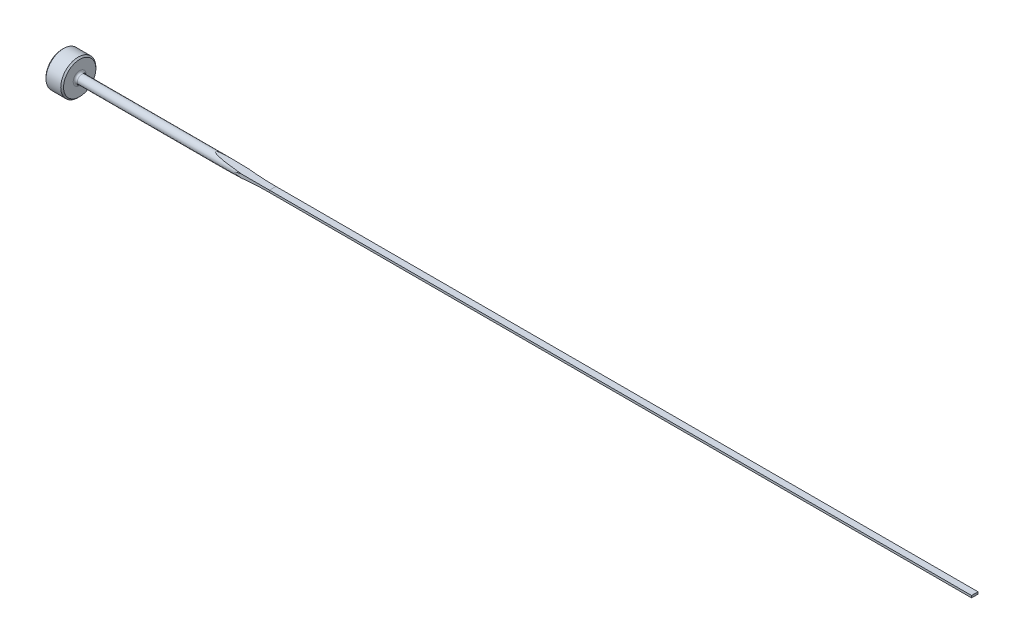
ISO-10303-21;
HEADER;
FILE_DESCRIPTION(('STEP AP214'),'2;1');
FILE_NAME('part.step','',(''),(''),'','','');
FILE_SCHEMA(('AUTOMOTIVE_DESIGN { 1 0 10303 214 1 1 1 1 }'));
ENDSEC;
DATA;
#1=APPLICATION_CONTEXT('core data for automotive mechanical design processes');
#2=APPLICATION_PROTOCOL_DEFINITION('international standard','automotive_design',2000,#1);
#3=PRODUCT_CONTEXT('',#1,'mechanical');
#4=PRODUCT('Part','Part','',(#3));
#5=PRODUCT_RELATED_PRODUCT_CATEGORY('part','',(#4));
#6=PRODUCT_DEFINITION_FORMATION('','',#4);
#7=PRODUCT_DEFINITION_CONTEXT('part definition',#1,'design');
#8=PRODUCT_DEFINITION('design','',#6,#7);
#9=PRODUCT_DEFINITION_SHAPE('','',#8);
#10=(LENGTH_UNIT() NAMED_UNIT(*) SI_UNIT(.MILLI.,.METRE.));
#11=(NAMED_UNIT(*) PLANE_ANGLE_UNIT() SI_UNIT($,.RADIAN.));
#12=(NAMED_UNIT(*) SI_UNIT($,.STERADIAN.) SOLID_ANGLE_UNIT());
#13=UNCERTAINTY_MEASURE_WITH_UNIT(LENGTH_MEASURE(1.E-05),#10,'distance_accuracy_value','');
#14=(GEOMETRIC_REPRESENTATION_CONTEXT(3) GLOBAL_UNCERTAINTY_ASSIGNED_CONTEXT((#13)) GLOBAL_UNIT_ASSIGNED_CONTEXT((#10,
#11,#12)) REPRESENTATION_CONTEXT('',''));
#15=CARTESIAN_POINT('',(0.,0.,0.));
#16=DIRECTION('',(0.,0.,1.));
#17=DIRECTION('',(1.,0.,0.));
#18=AXIS2_PLACEMENT_3D('',#15,#16,#17);
#19=CARTESIAN_POINT('',(0.,0.,0.));
#20=DIRECTION('',(-1.,0.,0.));
#21=DIRECTION('',(0.,0.,1.));
#22=AXIS2_PLACEMENT_3D('',#19,#20,#21);
#23=CYLINDRICAL_SURFACE('',#22,0.79375);
#24=CARTESIAN_POINT('',(3.556,0.,0.));
#25=DIRECTION('',(-1.,0.,0.));
#26=DIRECTION('',(0.,0.,1.));
#27=AXIS2_PLACEMENT_3D('',#24,#25,#26);
#28=CIRCLE('',#27,0.79375);
#29=CARTESIAN_POINT('',(3.556,0.,0.79375));
#30=VERTEX_POINT('',#29);
#31=EDGE_CURVE('E153',#30,#30,#28,.F.);
#32=ORIENTED_EDGE('',*,*,#31,.T.);
#33=EDGE_LOOP('',(#32));
#34=FACE_BOUND('',#33,.T.);
#35=CARTESIAN_POINT('',(38.1,0.537354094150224,0.584199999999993));
#36=CARTESIAN_POINT('',(37.9677986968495,0.537352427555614,0.584199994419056));
#37=CARTESIAN_POINT('',(37.8355977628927,0.537033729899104,0.584494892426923));
#38=CARTESIAN_POINT('',(37.5711986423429,0.535747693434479,0.585674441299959));
#39=CARTESIAN_POINT('',(37.4390004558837,0.534780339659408,0.586559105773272));
#40=CARTESIAN_POINT('',(37.0420069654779,0.53087936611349,0.590101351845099));
#41=CARTESIAN_POINT('',(36.7772280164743,0.526946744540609,0.593647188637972));
#42=CARTESIAN_POINT('',(36.2475584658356,0.516094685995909,0.603107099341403));
#43=CARTESIAN_POINT('',(35.9826679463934,0.509172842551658,0.609023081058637));
#44=CARTESIAN_POINT('',(35.4530338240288,0.491693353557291,0.623220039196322));
#45=CARTESIAN_POINT('',(35.18829024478,0.481135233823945,0.631501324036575));
#46=CARTESIAN_POINT('',(34.6594832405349,0.455276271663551,0.650407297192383));
#47=CARTESIAN_POINT('',(34.3954193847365,0.439982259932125,0.661028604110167));
#48=CARTESIAN_POINT('',(33.99981069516,0.411723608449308,0.678705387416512));
#49=CARTESIAN_POINT('',(33.8680369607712,0.401419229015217,0.684887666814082));
#50=CARTESIAN_POINT('',(33.604722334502,0.378486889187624,0.697828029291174));
#51=CARTESIAN_POINT('',(33.4731814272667,0.365859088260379,0.704586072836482));
#52=CARTESIAN_POINT('',(33.2761769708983,0.344482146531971,0.715145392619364));
#53=CARTESIAN_POINT('',(33.2105699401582,0.336951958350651,0.71873496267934));
#54=CARTESIAN_POINT('',(33.0794798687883,0.320881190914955,0.726052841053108));
#55=CARTESIAN_POINT('',(33.0139968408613,0.312340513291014,0.729781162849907));
#56=CARTESIAN_POINT('',(32.8830735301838,0.293954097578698,0.737380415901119));
#57=CARTESIAN_POINT('',(32.8176336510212,0.284105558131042,0.741251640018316));
#58=CARTESIAN_POINT('',(32.6870608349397,0.262655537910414,0.749120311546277));
#59=CARTESIAN_POINT('',(32.6219278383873,0.251054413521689,0.753117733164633));
#60=CARTESIAN_POINT('',(32.4919403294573,0.22526665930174,0.761238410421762));
#61=CARTESIAN_POINT('',(32.4270873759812,0.211071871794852,0.765362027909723));
#62=CARTESIAN_POINT('',(32.3307839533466,0.1864338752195,0.771589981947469));
#63=CARTESIAN_POINT('',(32.2989102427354,0.177685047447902,0.773668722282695));
#64=CARTESIAN_POINT('',(32.2356848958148,0.158500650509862,0.777825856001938));
#65=CARTESIAN_POINT('',(32.2043331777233,0.148065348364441,0.779904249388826));
#66=CARTESIAN_POINT('',(32.1449685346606,0.12536357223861,0.783870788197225));
#67=CARTESIAN_POINT('',(32.1168860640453,0.113303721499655,0.785761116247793));
#68=CARTESIAN_POINT('',(32.0787827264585,0.0926836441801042,0.788342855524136));
#69=CARTESIAN_POINT('',(32.0676987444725,0.0861257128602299,0.789096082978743));
#70=CARTESIAN_POINT('',(32.0464596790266,0.0716589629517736,0.790543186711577));
#71=CARTESIAN_POINT('',(32.0362989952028,0.0637592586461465,0.791237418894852));
#72=CARTESIAN_POINT('',(32.0241935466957,0.0517558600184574,0.792066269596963));
#73=CARTESIAN_POINT('',(32.0212914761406,0.0486376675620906,0.792265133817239));
#74=CARTESIAN_POINT('',(32.0158307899,0.0421001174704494,0.792639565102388));
#75=CARTESIAN_POINT('',(32.0132726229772,0.0386803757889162,0.792815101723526));
#76=CARTESIAN_POINT('',(32.0086203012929,0.0314630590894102,0.793134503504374));
#77=CARTESIAN_POINT('',(32.0065328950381,0.0276609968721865,0.793277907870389));
#78=CARTESIAN_POINT('',(32.0030925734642,0.0197374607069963,0.793514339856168));
#79=CARTESIAN_POINT('',(32.0017370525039,0.0156171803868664,0.793607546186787));
#80=CARTESIAN_POINT('',(32.0002141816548,0.00832744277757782,0.793712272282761));
#81=CARTESIAN_POINT('',(31.9998236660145,0.00520497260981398,0.793739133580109));
#82=CARTESIAN_POINT('',(31.9995863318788,-0.00106099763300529,0.793755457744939));
#83=CARTESIAN_POINT('',(31.9997393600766,-0.00420449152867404,0.793744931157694));
#84=CARTESIAN_POINT('',(32.0005699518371,-0.0104090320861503,0.793687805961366));
#85=CARTESIAN_POINT('',(32.0012458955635,-0.013470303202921,0.793641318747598));
#86=CARTESIAN_POINT('',(32.0030509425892,-0.0194544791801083,0.793517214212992));
#87=CARTESIAN_POINT('',(32.0041804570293,-0.0223772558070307,0.79343956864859));
#88=CARTESIAN_POINT('',(32.0075834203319,-0.0297362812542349,0.793205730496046));
#89=CARTESIAN_POINT('',(32.010137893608,-0.0340408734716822,0.793030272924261));
#90=CARTESIAN_POINT('',(32.0158647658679,-0.0422141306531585,0.792637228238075));
#91=CARTESIAN_POINT('',(32.0190391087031,-0.0460813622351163,0.792419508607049));
#92=CARTESIAN_POINT('',(32.0306425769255,-0.0587562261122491,0.791624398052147));
#93=CARTESIAN_POINT('',(32.0400482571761,-0.0666461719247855,0.790981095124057));
#94=CARTESIAN_POINT('',(32.0598384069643,-0.0810740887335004,0.78963111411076));
#95=CARTESIAN_POINT('',(32.070228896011,-0.0876028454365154,0.788924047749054));
#96=CARTESIAN_POINT('',(32.1002052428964,-0.104735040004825,0.786889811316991));
#97=CARTESIAN_POINT('',(32.1203710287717,-0.114312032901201,0.785527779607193));
#98=CARTESIAN_POINT('',(32.1614041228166,-0.131848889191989,0.782770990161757));
#99=CARTESIAN_POINT('',(32.1822732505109,-0.13980411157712,0.78137615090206));
#100=CARTESIAN_POINT('',(32.2454933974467,-0.162091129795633,0.777173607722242));
#101=CARTESIAN_POINT('',(32.288404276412,-0.17481938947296,0.774351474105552));
#102=CARTESIAN_POINT('',(32.4170052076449,-0.20942402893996,0.765989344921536));
#103=CARTESIAN_POINT('',(32.5035078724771,-0.228079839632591,0.760489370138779));
#104=CARTESIAN_POINT('',(32.6773949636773,-0.261317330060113,0.749691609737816));
#105=CARTESIAN_POINT('',(32.7647806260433,-0.275892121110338,0.744394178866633));
#106=CARTESIAN_POINT('',(32.9398406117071,-0.302364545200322,0.734042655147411));
#107=CARTESIAN_POINT('',(33.0275143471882,-0.314265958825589,0.728988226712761));
#108=CARTESIAN_POINT('',(33.2030327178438,-0.336200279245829,0.719131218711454));
#109=CARTESIAN_POINT('',(33.2908771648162,-0.346234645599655,0.714328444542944));
#110=CARTESIAN_POINT('',(33.5696341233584,-0.375842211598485,0.699503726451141));
#111=CARTESIAN_POINT('',(33.7608447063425,-0.392834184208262,0.689952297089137));
#112=CARTESIAN_POINT('',(34.1436524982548,-0.422669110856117,0.672072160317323));
#113=CARTESIAN_POINT('',(34.3352497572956,-0.435511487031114,0.663743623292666));
#114=CARTESIAN_POINT('',(34.718807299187,-0.458164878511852,0.648315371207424));
#115=CARTESIAN_POINT('',(34.9107677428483,-0.467973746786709,0.641216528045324));
#116=CARTESIAN_POINT('',(35.2948219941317,-0.485222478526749,0.628261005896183));
#117=CARTESIAN_POINT('',(35.4869157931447,-0.492662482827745,0.622404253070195));
#118=CARTESIAN_POINT('',(36.0633489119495,-0.512094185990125,0.60670099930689));
#119=CARTESIAN_POINT('',(36.447838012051,-0.521197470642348,0.59872158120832));
#120=CARTESIAN_POINT('',(37.2168658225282,-0.533520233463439,0.587755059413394));
#121=CARTESIAN_POINT('',(37.6014044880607,-0.536741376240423,0.584766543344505));
#122=CARTESIAN_POINT('',(38.0239617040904,-0.537327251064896,0.584224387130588));
#123=CARTESIAN_POINT('',(38.0619808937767,-0.537353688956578,0.584199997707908));
#124=CARTESIAN_POINT('',(38.1,-0.537354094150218,0.584199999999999));
#125=B_SPLINE_CURVE_WITH_KNOTS('',3,(#35,#36,#37,#38,#39,#40,#41,#42,#43,#44,#45,#46,#47,#48,
#49,#50,#51,#52,#53,#54,#55,#56,#57,#58,#59,#60,#61,#62,#63,#64,#65,#66,#67,#68,#69,#70,#71,#72,
#73,#74,#75,#76,#77,#78,#79,#80,#81,#82,#83,#84,#85,#86,#87,#88,#89,#90,#91,#92,#93,#94,#95,#96,
#97,#98,#99,#100,#101,#102,#103,#104,#105,#106,#107,#108,#109,#110,#111,#112,#113,#114,#115,
#116,#117,#118,#119,#120,#121,#122,#123,#124),.UNSPECIFIED.,.F.,.F.,(4,2,2,2,2,2,2,2,2,2,2,2,2,
2,2,2,2,2,2,2,2,2,2,2,2,2,2,2,2,2,2,2,2,2,2,2,2,2,2,2,2,2,2,2,4),(0.,0.396602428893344,
0.793214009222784,1.58768292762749,2.38279262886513,3.1780060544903,3.97207782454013,
4.36902531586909,4.76594557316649,4.9643452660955,5.16276428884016,5.36161538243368,
5.56042609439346,5.75987322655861,5.85918782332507,5.95848671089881,6.05003157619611,
6.08869793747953,6.12711144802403,6.13988635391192,6.15267777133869,6.16564230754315,
6.17856037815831,6.18795697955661,6.19735093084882,6.20671589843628,6.21608937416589,
6.23102781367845,6.24601387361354,6.28261070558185,6.3194477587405,6.38636719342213,
6.45347552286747,6.58786698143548,6.85363398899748,7.11984693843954,7.38568101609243,
7.65130639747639,8.22782048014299,8.80441481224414,9.38141631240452,9.95838350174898,
11.1123237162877,12.2659373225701,12.37999486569),.UNSPECIFIED.);
#126=CARTESIAN_POINT('',(33.1437773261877,0.328763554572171,0.722463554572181));
#127=VERTEX_POINT('',#126);
#128=CARTESIAN_POINT('',(33.1437773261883,-0.328763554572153,0.722463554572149));
#129=VERTEX_POINT('',#128);
#130=EDGE_CURVE('E156',#127,#129,#125,.T.);
#131=ORIENTED_EDGE('',*,*,#130,.F.);
#132=CARTESIAN_POINT('',(38.1,0.190499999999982,0.770550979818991));
#133=CARTESIAN_POINT('',(37.8354977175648,0.190500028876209,0.770543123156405));
#134=CARTESIAN_POINT('',(37.5709978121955,0.191680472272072,0.770261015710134));
#135=CARTESIAN_POINT('',(37.0418252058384,0.196403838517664,0.769072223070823));
#136=CARTESIAN_POINT('',(36.7771525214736,0.19994850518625,0.768165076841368));
#137=CARTESIAN_POINT('',(35.9824806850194,0.214141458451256,0.764388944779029));
#138=CARTESIAN_POINT('',(35.4525422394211,0.22834871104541,0.760464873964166));
#139=CARTESIAN_POINT('',(34.6578861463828,0.256766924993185,0.751134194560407));
#140=CARTESIAN_POINT('',(34.393015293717,0.267425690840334,0.747449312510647));
#141=CARTESIAN_POINT('',(33.8634058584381,0.291110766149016,0.738549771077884));
#142=CARTESIAN_POINT('',(33.5986672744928,0.3041370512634,0.733335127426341));
#143=CARTESIAN_POINT('',(33.0695875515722,0.332542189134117,0.720898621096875));
#144=CARTESIAN_POINT('',(32.8052462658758,0.347919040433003,0.713678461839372));
#145=CARTESIAN_POINT('',(32.2767983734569,0.381028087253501,0.696567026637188));
#146=CARTESIAN_POINT('',(32.0126917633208,0.398760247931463,0.686675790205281));
#147=CARTESIAN_POINT('',(31.4849021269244,0.436563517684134,0.663283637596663));
#148=CARTESIAN_POINT('',(31.2212189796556,0.456633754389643,0.649784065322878));
#149=CARTESIAN_POINT('',(30.6943507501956,0.49909984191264,0.61778429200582));
#150=CARTESIAN_POINT('',(30.431165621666,0.521495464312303,0.599284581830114));
#151=CARTESIAN_POINT('',(30.0370166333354,0.556801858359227,0.56592143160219));
#152=CARTESIAN_POINT('',(29.9057389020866,0.568856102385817,0.553864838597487));
#153=CARTESIAN_POINT('',(29.6434383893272,0.59352876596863,0.527346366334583));
#154=CARTESIAN_POINT('',(29.5124156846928,0.606147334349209,0.512883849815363));
#155=CARTESIAN_POINT('',(29.2506137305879,0.631946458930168,0.480735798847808));
#156=CARTESIAN_POINT('',(29.1198351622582,0.645127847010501,0.463045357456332));
#157=CARTESIAN_POINT('',(28.8590586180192,0.671994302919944,0.423151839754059));
#158=CARTESIAN_POINT('',(28.7290602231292,0.685679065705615,0.400951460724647));
#159=CARTESIAN_POINT('',(28.5485864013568,0.705076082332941,0.364742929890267));
#160=CARTESIAN_POINT('',(28.4974648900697,0.710615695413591,0.353876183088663));
#161=CARTESIAN_POINT('',(28.3955354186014,0.721749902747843,0.33058349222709));
#162=CARTESIAN_POINT('',(28.3447277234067,0.727344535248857,0.318156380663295));
#163=CARTESIAN_POINT('',(28.2437790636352,0.738547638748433,0.291200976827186));
#164=CARTESIAN_POINT('',(28.1936370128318,0.744156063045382,0.276676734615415));
#165=CARTESIAN_POINT('',(28.0943683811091,0.755343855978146,0.244529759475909));
#166=CARTESIAN_POINT('',(28.0452403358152,0.760923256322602,0.226911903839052));
#167=CARTESIAN_POINT('',(27.9731852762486,0.769164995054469,0.196296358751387));
#168=CARTESIAN_POINT('',(27.9493942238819,0.771896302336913,0.185367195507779));
#169=CARTESIAN_POINT('',(27.9028927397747,0.777253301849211,0.161463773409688));
#170=CARTESIAN_POINT('',(27.8801786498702,0.779879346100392,0.148497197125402));
#171=CARTESIAN_POINT('',(27.8500391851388,0.783374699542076,0.128048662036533));
#172=CARTESIAN_POINT('',(27.8416704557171,0.784346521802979,0.121988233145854));
#173=CARTESIAN_POINT('',(27.8254335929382,0.786234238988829,0.109166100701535));
#174=CARTESIAN_POINT('',(27.8175668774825,0.787149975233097,0.102402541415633));
#175=CARTESIAN_POINT('',(27.8025456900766,0.788900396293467,0.087916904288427));
#176=CARTESIAN_POINT('',(27.7954016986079,0.789733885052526,0.0801836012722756));
#177=CARTESIAN_POINT('',(27.7825061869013,0.791239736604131,0.0636171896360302));
#178=CARTESIAN_POINT('',(27.7767475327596,0.791912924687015,0.0547900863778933));
#179=CARTESIAN_POINT('',(27.7696621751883,0.792741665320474,0.0403159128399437));
#180=CARTESIAN_POINT('',(27.7675163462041,0.792992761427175,0.0350797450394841));
#181=CARTESIAN_POINT('',(27.764077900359,0.793395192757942,0.0243299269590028));
#182=CARTESIAN_POINT('',(27.7627841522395,0.793546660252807,0.0188166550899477));
#183=CARTESIAN_POINT('',(27.7611884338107,0.793733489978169,0.00760256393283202));
#184=CARTESIAN_POINT('',(27.7608934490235,0.793768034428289,0.00190070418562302));
#185=CARTESIAN_POINT('',(27.7613552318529,0.793713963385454,-0.00946090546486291));
#186=CARTESIAN_POINT('',(27.7621124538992,0.793625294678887,-0.0151206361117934));
#187=CARTESIAN_POINT('',(27.76448784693,0.793347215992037,-0.025801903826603));
#188=CARTESIAN_POINT('',(27.7660373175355,0.793165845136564,-0.0308394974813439));
#189=CARTESIAN_POINT('',(27.7698145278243,0.792723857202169,-0.0406454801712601));
#190=CARTESIAN_POINT('',(27.772042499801,0.792463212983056,-0.0454137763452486));
#191=CARTESIAN_POINT('',(27.7790063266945,0.791648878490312,-0.0583107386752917));
#192=CARTESIAN_POINT('',(27.7843320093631,0.791026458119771,-0.0661144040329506));
#193=CARTESIAN_POINT('',(27.796067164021,0.78965626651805,-0.0808494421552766));
#194=CARTESIAN_POINT('',(27.8024807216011,0.788908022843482,-0.0877773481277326));
#195=CARTESIAN_POINT('',(27.8270824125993,0.786040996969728,-0.11176765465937));
#196=CARTESIAN_POINT('',(27.8472565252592,0.78369571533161,-0.126716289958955));
#197=CARTESIAN_POINT('',(27.8893601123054,0.778817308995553,-0.153835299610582));
#198=CARTESIAN_POINT('',(27.9113004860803,0.776283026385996,-0.165986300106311));
#199=CARTESIAN_POINT('',(27.9770598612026,0.768713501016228,-0.199075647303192));
#200=CARTESIAN_POINT('',(28.0220934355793,0.763562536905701,-0.217563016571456));
#201=CARTESIAN_POINT('',(28.1134440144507,0.753187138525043,-0.251080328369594));
#202=CARTESIAN_POINT('',(28.1597643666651,0.747962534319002,-0.266100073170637));
#203=CARTESIAN_POINT('',(28.2531707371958,0.73750253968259,-0.293855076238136));
#204=CARTESIAN_POINT('',(28.3002578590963,0.732267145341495,-0.30658665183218));
#205=CARTESIAN_POINT('',(28.3947678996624,0.721836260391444,-0.330390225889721));
#206=CARTESIAN_POINT('',(28.442190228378,0.716640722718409,-0.341464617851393));
#207=CARTESIAN_POINT('',(28.5839153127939,0.701229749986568,-0.372633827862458));
#208=CARTESIAN_POINT('',(28.6786194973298,0.691084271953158,-0.390933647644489));
#209=CARTESIAN_POINT('',(28.8686125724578,0.671041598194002,-0.424400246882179));
#210=CARTESIAN_POINT('',(28.9639016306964,0.661144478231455,-0.439566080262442));
#211=CARTESIAN_POINT('',(29.1549690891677,0.641612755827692,-0.467616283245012));
#212=CARTESIAN_POINT('',(29.2507479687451,0.631978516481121,-0.4804976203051));
#213=CARTESIAN_POINT('',(29.442558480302,0.613000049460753,-0.504481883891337));
#214=CARTESIAN_POINT('',(29.5385901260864,0.603655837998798,-0.515584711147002));
#215=CARTESIAN_POINT('',(29.8266907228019,0.576097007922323,-0.546742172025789));
#216=CARTESIAN_POINT('',(30.0190308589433,0.558329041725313,-0.564682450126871));
#217=CARTESIAN_POINT('',(30.4039936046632,0.524034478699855,-0.596629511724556));
#218=CARTESIAN_POINT('',(30.5966159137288,0.507507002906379,-0.610639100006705));
#219=CARTESIAN_POINT('',(31.0885389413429,0.466916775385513,-0.642671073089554));
#220=CARTESIAN_POINT('',(31.3880448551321,0.443729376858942,-0.658640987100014));
#221=CARTESIAN_POINT('',(31.987497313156,0.400378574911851,-0.68584330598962));
#222=CARTESIAN_POINT('',(32.2874438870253,0.380215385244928,-0.697075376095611));
#223=CARTESIAN_POINT('',(32.8877695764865,0.342918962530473,-0.716159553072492));
#224=CARTESIAN_POINT('',(33.1881488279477,0.325787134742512,-0.724010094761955));
#225=CARTESIAN_POINT('',(33.7891202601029,0.29457185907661,-0.737260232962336));
#226=CARTESIAN_POINT('',(34.0897124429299,0.28048844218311,-0.74265980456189));
#227=CARTESIAN_POINT('',(34.690987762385,0.25537655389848,-0.751664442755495));
#228=CARTESIAN_POINT('',(34.9916708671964,0.244347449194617,-0.755269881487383));
#229=CARTESIAN_POINT('',(35.5931486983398,0.225342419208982,-0.761156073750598));
#230=CARTESIAN_POINT('',(35.8939434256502,0.217366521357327,-0.763436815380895));
#231=CARTESIAN_POINT('',(36.495546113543,0.204470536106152,-0.766991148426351));
#232=CARTESIAN_POINT('',(36.7963540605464,0.199549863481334,-0.768264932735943));
#233=CARTESIAN_POINT('',(37.3980062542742,0.192762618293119,-0.769996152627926));
#234=CARTESIAN_POINT('',(37.6988505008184,0.190896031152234,-0.770453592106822));
#235=CARTESIAN_POINT('',(38.0331297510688,0.19051886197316,-0.770546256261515));
#236=CARTESIAN_POINT('',(38.06656488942,0.190499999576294,-0.77055090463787));
#237=CARTESIAN_POINT('',(38.1,0.190499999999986,-0.77055097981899));
#238=B_SPLINE_CURVE_WITH_KNOTS('',3,(#132,#133,#134,#135,#136,#137,#138,#139,#140,#141,#142,
#143,#144,#145,#146,#147,#148,#149,#150,#151,#152,#153,#154,#155,#156,#157,#158,#159,#160,#161,
#162,#163,#164,#165,#166,#167,#168,#169,#170,#171,#172,#173,#174,#175,#176,#177,#178,#179,#180,
#181,#182,#183,#184,#185,#186,#187,#188,#189,#190,#191,#192,#193,#194,#195,#196,#197,#198,#199,
#200,#201,#202,#203,#204,#205,#206,#207,#208,#209,#210,#211,#212,#213,#214,#215,#216,#217,#218,
#219,#220,#221,#222,#223,#224,#225,#226,#227,#228,#229,#230,#231,#232,#233,#234,#235,#236,#237),
.UNSPECIFIED.,.F.,.F.,(4,2,2,2,2,2,2,2,2,2,2,2,2,2,2,2,2,2,2,2,2,2,2,2,2,2,2,2,2,2,2,2,2,2,2,2,
2,2,2,2,2,2,2,2,2,2,2,2,2,2,2,2,4),(0.,0.793499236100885,1.58758439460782,3.17789787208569,
3.97321935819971,4.76853266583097,5.56317251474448,6.35780060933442,7.15213316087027,
7.94638776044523,8.34351214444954,8.74074188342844,9.13858058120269,9.53618203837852,
9.69383605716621,9.85160874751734,10.0090807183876,10.1663066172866,10.2452331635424,
10.3238689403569,10.3549791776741,10.3861737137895,10.4177700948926,10.4492001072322,
10.466134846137,10.4830470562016,10.5000773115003,10.5171149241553,10.5328769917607,
10.5486444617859,10.5768825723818,10.6052291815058,10.6802907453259,10.7558574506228,
10.9023193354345,11.0492066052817,11.1963282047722,11.3432352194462,11.634101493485,
11.9250554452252,12.2163927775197,12.5077463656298,13.0896456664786,13.6711286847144,
14.5735272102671,15.4759894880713,16.3788690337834,17.2817577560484,18.1844591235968,
19.087168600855,19.9897051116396,20.8922373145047,20.9925427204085),.UNSPECIFIED.);
#239=CARTESIAN_POINT('',(33.1437773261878,0.328763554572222,-0.722463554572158));
#240=VERTEX_POINT('',#239);
#241=EDGE_CURVE('E106',#127,#240,#238,.T.);
#242=ORIENTED_EDGE('',*,*,#241,.T.);
#243=CARTESIAN_POINT('',(38.1,0.537354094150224,-0.584199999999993));
#244=CARTESIAN_POINT('',(37.9677986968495,0.537352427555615,-0.584199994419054));
#245=CARTESIAN_POINT('',(37.8355977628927,0.537033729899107,-0.584494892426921));
#246=CARTESIAN_POINT('',(37.5711986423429,0.535747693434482,-0.585674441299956));
#247=CARTESIAN_POINT('',(37.4390004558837,0.534780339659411,-0.586559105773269));
#248=CARTESIAN_POINT('',(37.0420069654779,0.530879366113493,-0.590101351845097));
#249=CARTESIAN_POINT('',(36.7772280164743,0.526946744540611,-0.593647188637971));
#250=CARTESIAN_POINT('',(36.2475584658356,0.516094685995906,-0.603107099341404));
#251=CARTESIAN_POINT('',(35.9826679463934,0.509172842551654,-0.60902308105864));
#252=CARTESIAN_POINT('',(35.4530338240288,0.491693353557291,-0.623220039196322));
#253=CARTESIAN_POINT('',(35.18829024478,0.481135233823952,-0.63150132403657));
#254=CARTESIAN_POINT('',(34.6594832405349,0.455276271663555,-0.65040729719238));
#255=CARTESIAN_POINT('',(34.3954193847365,0.439982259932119,-0.661028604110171));
#256=CARTESIAN_POINT('',(33.99981069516,0.411723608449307,-0.678705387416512));
#257=CARTESIAN_POINT('',(33.8680369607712,0.401419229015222,-0.684887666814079));
#258=CARTESIAN_POINT('',(33.6047223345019,0.378486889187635,-0.697828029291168));
#259=CARTESIAN_POINT('',(33.4731814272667,0.365859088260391,-0.704586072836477));
#260=CARTESIAN_POINT('',(33.2761769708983,0.344482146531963,-0.715145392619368));
#261=CARTESIAN_POINT('',(33.2105699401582,0.336951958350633,-0.718734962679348));
#262=CARTESIAN_POINT('',(33.0794798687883,0.320881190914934,-0.726052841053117));
#263=CARTESIAN_POINT('',(33.0139968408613,0.312340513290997,-0.729781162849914));
#264=CARTESIAN_POINT('',(32.8830735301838,0.29395409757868,-0.737380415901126));
#265=CARTESIAN_POINT('',(32.8176336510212,0.284105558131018,-0.741251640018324));
#266=CARTESIAN_POINT('',(32.6870608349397,0.262655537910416,-0.749120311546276));
#267=CARTESIAN_POINT('',(32.6219278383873,0.251054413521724,-0.753117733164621));
#268=CARTESIAN_POINT('',(32.4919403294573,0.225266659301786,-0.761238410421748));
#269=CARTESIAN_POINT('',(32.4270873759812,0.211071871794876,-0.765362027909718));
#270=CARTESIAN_POINT('',(32.3307839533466,0.186433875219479,-0.771589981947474));
#271=CARTESIAN_POINT('',(32.2989102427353,0.177685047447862,-0.773668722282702));
#272=CARTESIAN_POINT('',(32.2356848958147,0.15850065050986,-0.77782585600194));
#273=CARTESIAN_POINT('',(32.2043331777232,0.148065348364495,-0.779904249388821));
#274=CARTESIAN_POINT('',(32.1449685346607,0.125363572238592,-0.783870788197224));
#275=CARTESIAN_POINT('',(32.1168860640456,0.113303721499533,-0.785761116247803));
#276=CARTESIAN_POINT('',(32.0787827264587,0.0926836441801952,-0.788342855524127));
#277=CARTESIAN_POINT('',(32.0676987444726,0.0861257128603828,-0.789096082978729));
#278=CARTESIAN_POINT('',(32.0464596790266,0.0716589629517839,-0.790543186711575));
#279=CARTESIAN_POINT('',(32.0362989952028,0.0637592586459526,-0.791237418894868));
#280=CARTESIAN_POINT('',(32.0241935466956,0.0517558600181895,-0.792066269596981));
#281=CARTESIAN_POINT('',(32.0212914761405,0.0486376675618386,-0.792265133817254));
#282=CARTESIAN_POINT('',(32.0158307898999,0.0421001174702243,-0.7926395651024));
#283=CARTESIAN_POINT('',(32.0132726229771,0.0386803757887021,-0.792815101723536));
#284=CARTESIAN_POINT('',(32.0086203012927,0.0314630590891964,-0.793134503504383));
#285=CARTESIAN_POINT('',(32.006532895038,0.0276609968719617,-0.793277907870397));
#286=CARTESIAN_POINT('',(32.0030925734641,0.0197374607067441,-0.793514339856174));
#287=CARTESIAN_POINT('',(32.0017370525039,0.0156171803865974,-0.793607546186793));
#288=CARTESIAN_POINT('',(32.0002141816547,0.00832744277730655,-0.793712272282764));
#289=CARTESIAN_POINT('',(31.9998236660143,0.00520497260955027,-0.793739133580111));
#290=CARTESIAN_POINT('',(31.9995863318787,-0.00106099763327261,-0.793755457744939));
#291=CARTESIAN_POINT('',(31.9997393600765,-0.00420449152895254,-0.793744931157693));
#292=CARTESIAN_POINT('',(32.0005699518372,-0.0104090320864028,-0.793687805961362));
#293=CARTESIAN_POINT('',(32.0012458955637,-0.0134703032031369,-0.793641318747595));
#294=CARTESIAN_POINT('',(32.0030509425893,-0.0194544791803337,-0.793517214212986));
#295=CARTESIAN_POINT('',(32.0041804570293,-0.0223772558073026,-0.793439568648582));
#296=CARTESIAN_POINT('',(32.0075834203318,-0.0297362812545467,-0.793205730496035));
#297=CARTESIAN_POINT('',(32.0101378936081,-0.0340408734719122,-0.793030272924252));
#298=CARTESIAN_POINT('',(32.0158647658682,-0.0422141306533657,-0.792637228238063));
#299=CARTESIAN_POINT('',(32.0190391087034,-0.0460813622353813,-0.792419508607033));
#300=CARTESIAN_POINT('',(32.0306425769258,-0.058756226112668,-0.791624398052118));
#301=CARTESIAN_POINT('',(32.0400482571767,-0.0666461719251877,-0.790981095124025));
#302=CARTESIAN_POINT('',(32.0598384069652,-0.0810740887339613,-0.789631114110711));
#303=CARTESIAN_POINT('',(32.0702288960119,-0.0876028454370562,-0.788924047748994));
#304=CARTESIAN_POINT('',(32.1002052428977,-0.104735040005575,-0.786889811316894));
#305=CARTESIAN_POINT('',(32.1203710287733,-0.114312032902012,-0.785527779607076));
#306=CARTESIAN_POINT('',(32.1614041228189,-0.131848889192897,-0.782770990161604));
#307=CARTESIAN_POINT('',(32.1822732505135,-0.139804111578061,-0.781376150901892));
#308=CARTESIAN_POINT('',(32.2454933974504,-0.162091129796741,-0.777173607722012));
#309=CARTESIAN_POINT('',(32.2884042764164,-0.174819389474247,-0.774351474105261));
#310=CARTESIAN_POINT('',(32.4170052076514,-0.209424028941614,-0.765989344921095));
#311=CARTESIAN_POINT('',(32.503507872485,-0.22807983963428,-0.760489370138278));
#312=CARTESIAN_POINT('',(32.677394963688,-0.261317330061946,-0.749691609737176));
#313=CARTESIAN_POINT('',(32.7647806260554,-0.275892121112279,-0.744394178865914));
#314=CARTESIAN_POINT('',(32.9398406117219,-0.302364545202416,-0.734042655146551));
#315=CARTESIAN_POINT('',(33.0275143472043,-0.314265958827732,-0.728988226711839));
#316=CARTESIAN_POINT('',(33.2030327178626,-0.336200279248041,-0.71913121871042));
#317=CARTESIAN_POINT('',(33.2908771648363,-0.346234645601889,-0.714328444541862));
#318=CARTESIAN_POINT('',(33.569634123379,-0.375842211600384,-0.699503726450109));
#319=CARTESIAN_POINT('',(33.7608447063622,-0.392834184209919,-0.689952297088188));
#320=CARTESIAN_POINT('',(34.1436524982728,-0.422669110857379,-0.672072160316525));
#321=CARTESIAN_POINT('',(34.3352497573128,-0.435511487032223,-0.663743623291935));
#322=CARTESIAN_POINT('',(34.7188072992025,-0.458164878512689,-0.648315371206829));
#323=CARTESIAN_POINT('',(34.9107677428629,-0.467973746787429,-0.641216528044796));
#324=CARTESIAN_POINT('',(35.2948219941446,-0.48522247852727,-0.628261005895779));
#325=CARTESIAN_POINT('',(35.4869157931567,-0.492662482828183,-0.622404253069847));
#326=CARTESIAN_POINT('',(36.063348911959,-0.512094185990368,-0.606700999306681));
#327=CARTESIAN_POINT('',(36.4478380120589,-0.521197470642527,-0.598721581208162));
#328=CARTESIAN_POINT('',(37.2168658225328,-0.533520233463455,-0.58775505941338));
#329=CARTESIAN_POINT('',(37.6014044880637,-0.536741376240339,-0.584766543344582));
#330=CARTESIAN_POINT('',(38.0239617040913,-0.53732725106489,-0.584224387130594));
#331=CARTESIAN_POINT('',(38.0619808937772,-0.53735368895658,-0.584199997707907));
#332=CARTESIAN_POINT('',(38.1,-0.537354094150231,-0.584199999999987));
#333=B_SPLINE_CURVE_WITH_KNOTS('',3,(#243,#244,#245,#246,#247,#248,#249,#250,#251,#252,#253,
#254,#255,#256,#257,#258,#259,#260,#261,#262,#263,#264,#265,#266,#267,#268,#269,#270,#271,#272,
#273,#274,#275,#276,#277,#278,#279,#280,#281,#282,#283,#284,#285,#286,#287,#288,#289,#290,#291,
#292,#293,#294,#295,#296,#297,#298,#299,#300,#301,#302,#303,#304,#305,#306,#307,#308,#309,#310,
#311,#312,#313,#314,#315,#316,#317,#318,#319,#320,#321,#322,#323,#324,#325,#326,#327,#328,#329,
#330,#331,#332),.UNSPECIFIED.,.F.,.F.,(4,2,2,2,2,2,2,2,2,2,2,2,2,2,2,2,2,2,2,2,2,2,2,2,2,2,2,2,
2,2,2,2,2,2,2,2,2,2,2,2,2,2,2,2,4),(0.,0.396602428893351,0.793214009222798,1.58768292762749,
2.38279262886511,3.17800605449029,3.97207782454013,4.36902531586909,4.76594557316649,
4.96434526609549,5.16276428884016,5.36161538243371,5.56042609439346,5.75987322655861,
5.8591878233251,5.95848671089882,6.05003157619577,6.08869793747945,6.12711144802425,
6.13988635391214,6.15267777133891,6.16564230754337,6.17856037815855,6.18795697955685,
6.19735093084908,6.20671589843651,6.2160893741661,6.23102781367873,6.24601387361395,
6.28261070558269,6.31944775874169,6.38636719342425,6.45347552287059,6.58786698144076,
6.85363398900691,7.11984693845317,7.38568101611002,7.65130639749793,8.22782048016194,
8.80441481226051,9.38141631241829,9.95838350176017,11.1123237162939,12.2659373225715,
12.37999486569),.UNSPECIFIED.);
#334=CARTESIAN_POINT('',(33.1437773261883,-0.328763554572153,-0.722463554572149));
#335=VERTEX_POINT('',#334);
#336=EDGE_CURVE('E175',#240,#335,#333,.T.);
#337=ORIENTED_EDGE('',*,*,#336,.T.);
#338=CARTESIAN_POINT('',(38.1,-0.190499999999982,0.770550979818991));
#339=CARTESIAN_POINT('',(37.8354977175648,-0.190500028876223,0.770543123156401));
#340=CARTESIAN_POINT('',(37.5709978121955,-0.191680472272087,0.77026101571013));
#341=CARTESIAN_POINT('',(37.0418252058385,-0.196403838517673,0.769072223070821));
#342=CARTESIAN_POINT('',(36.7771525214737,-0.199948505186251,0.768165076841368));
#343=CARTESIAN_POINT('',(35.9824806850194,-0.214141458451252,0.76438894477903));
#344=CARTESIAN_POINT('',(35.4525422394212,-0.228348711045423,0.760464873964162));
#345=CARTESIAN_POINT('',(34.6578861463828,-0.256766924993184,0.751134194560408));
#346=CARTESIAN_POINT('',(34.3930152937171,-0.267425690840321,0.747449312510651));
#347=CARTESIAN_POINT('',(33.8634058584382,-0.291110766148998,0.738549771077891));
#348=CARTESIAN_POINT('',(33.5986672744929,-0.304137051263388,0.733335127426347));
#349=CARTESIAN_POINT('',(33.0695875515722,-0.332542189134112,0.720898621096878));
#350=CARTESIAN_POINT('',(32.8052462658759,-0.347919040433,0.713678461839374));
#351=CARTESIAN_POINT('',(32.276798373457,-0.3810280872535,0.696567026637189));
#352=CARTESIAN_POINT('',(32.0126917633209,-0.398760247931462,0.686675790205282));
#353=CARTESIAN_POINT('',(31.4849021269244,-0.436563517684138,0.66328363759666));
#354=CARTESIAN_POINT('',(31.2212189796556,-0.456633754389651,0.649784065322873));
#355=CARTESIAN_POINT('',(30.6943507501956,-0.499099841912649,0.617784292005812));
#356=CARTESIAN_POINT('',(30.431165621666,-0.52149546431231,0.599284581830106));
#357=CARTESIAN_POINT('',(30.0370166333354,-0.55680185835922,0.565921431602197));
#358=CARTESIAN_POINT('',(29.9057389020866,-0.568856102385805,0.553864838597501));
#359=CARTESIAN_POINT('',(29.6434383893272,-0.593528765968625,0.527346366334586));
#360=CARTESIAN_POINT('',(29.5124156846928,-0.606147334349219,0.51288384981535));
#361=CARTESIAN_POINT('',(29.2506137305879,-0.631946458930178,0.480735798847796));
#362=CARTESIAN_POINT('',(29.1198351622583,-0.645127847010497,0.463045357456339));
#363=CARTESIAN_POINT('',(28.8590586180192,-0.671994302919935,0.42315183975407));
#364=CARTESIAN_POINT('',(28.7290602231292,-0.685679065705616,0.400951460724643));
#365=CARTESIAN_POINT('',(28.5485864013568,-0.705076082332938,0.364742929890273));
#366=CARTESIAN_POINT('',(28.4974648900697,-0.710615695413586,0.353876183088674));
#367=CARTESIAN_POINT('',(28.3955354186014,-0.721749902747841,0.330583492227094));
#368=CARTESIAN_POINT('',(28.3447277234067,-0.72734453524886,0.318156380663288));
#369=CARTESIAN_POINT('',(28.2437790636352,-0.738547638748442,0.291200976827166));
#370=CARTESIAN_POINT('',(28.1936370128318,-0.744156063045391,0.276676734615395));
#371=CARTESIAN_POINT('',(28.0943683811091,-0.755343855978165,0.244529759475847));
#372=CARTESIAN_POINT('',(28.0452403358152,-0.760923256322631,0.226911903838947));
#373=CARTESIAN_POINT('',(27.9731852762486,-0.769164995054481,0.196296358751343));
#374=CARTESIAN_POINT('',(27.9493942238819,-0.771896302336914,0.185367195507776));
#375=CARTESIAN_POINT('',(27.9028927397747,-0.77725330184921,0.161463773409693));
#376=CARTESIAN_POINT('',(27.8801786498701,-0.779879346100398,0.148497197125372));
#377=CARTESIAN_POINT('',(27.8500391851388,-0.783374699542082,0.128048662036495));
#378=CARTESIAN_POINT('',(27.8416704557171,-0.784346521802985,0.121988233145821));
#379=CARTESIAN_POINT('',(27.8254335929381,-0.786234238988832,0.109166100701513));
#380=CARTESIAN_POINT('',(27.8175668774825,-0.787149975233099,0.102402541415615));
#381=CARTESIAN_POINT('',(27.8025456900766,-0.788900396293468,0.0879169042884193));
#382=CARTESIAN_POINT('',(27.7954016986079,-0.789733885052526,0.0801836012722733));
#383=CARTESIAN_POINT('',(27.7825061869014,-0.791239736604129,0.0636171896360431));
#384=CARTESIAN_POINT('',(27.7767475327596,-0.791912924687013,0.0547900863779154));
#385=CARTESIAN_POINT('',(27.7696621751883,-0.792741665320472,0.0403159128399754));
#386=CARTESIAN_POINT('',(27.7675163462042,-0.792992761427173,0.0350797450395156));
#387=CARTESIAN_POINT('',(27.764077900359,-0.793395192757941,0.024329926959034));
#388=CARTESIAN_POINT('',(27.7627841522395,-0.793546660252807,0.0188166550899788));
#389=CARTESIAN_POINT('',(27.7611884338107,-0.793733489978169,0.00760256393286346));
#390=CARTESIAN_POINT('',(27.7608934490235,-0.793768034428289,0.00190070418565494));
#391=CARTESIAN_POINT('',(27.7613552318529,-0.793713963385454,-0.00946090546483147));
#392=CARTESIAN_POINT('',(27.7621124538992,-0.793625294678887,-0.0151206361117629));
#393=CARTESIAN_POINT('',(27.76448784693,-0.793347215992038,-0.0258019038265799));
#394=CARTESIAN_POINT('',(27.7660373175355,-0.793165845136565,-0.0308394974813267));
#395=CARTESIAN_POINT('',(27.7698145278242,-0.792723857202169,-0.0406454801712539));
#396=CARTESIAN_POINT('',(27.7720424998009,-0.792463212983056,-0.0454137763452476));
#397=CARTESIAN_POINT('',(27.7790063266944,-0.791648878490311,-0.0583107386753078));
#398=CARTESIAN_POINT('',(27.784332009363,-0.791026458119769,-0.0661144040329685));
#399=CARTESIAN_POINT('',(27.7960671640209,-0.78965626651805,-0.0808494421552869));
#400=CARTESIAN_POINT('',(27.8024807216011,-0.788908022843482,-0.0877773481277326));
#401=CARTESIAN_POINT('',(27.8270824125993,-0.786040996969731,-0.111767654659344));
#402=CARTESIAN_POINT('',(27.8472565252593,-0.783695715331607,-0.126716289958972));
#403=CARTESIAN_POINT('',(27.8893601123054,-0.778817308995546,-0.153835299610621));
#404=CARTESIAN_POINT('',(27.9113004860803,-0.776283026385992,-0.165986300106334));
#405=CARTESIAN_POINT('',(27.9770598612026,-0.768713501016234,-0.199075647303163));
#406=CARTESIAN_POINT('',(28.0220934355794,-0.763562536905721,-0.217563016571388));
#407=CARTESIAN_POINT('',(28.1134440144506,-0.753187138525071,-0.251080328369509));
#408=CARTESIAN_POINT('',(28.1597643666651,-0.747962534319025,-0.266100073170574));
#409=CARTESIAN_POINT('',(28.2531707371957,-0.737502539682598,-0.293855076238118));
#410=CARTESIAN_POINT('',(28.3002578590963,-0.732267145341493,-0.306586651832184));
#411=CARTESIAN_POINT('',(28.3947678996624,-0.721836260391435,-0.330390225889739));
#412=CARTESIAN_POINT('',(28.442190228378,-0.716640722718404,-0.341464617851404));
#413=CARTESIAN_POINT('',(28.5839153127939,-0.701229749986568,-0.372633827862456));
#414=CARTESIAN_POINT('',(28.6786194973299,-0.691084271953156,-0.390933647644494));
#415=CARTESIAN_POINT('',(28.8686125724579,-0.671041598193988,-0.424400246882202));
#416=CARTESIAN_POINT('',(28.9639016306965,-0.661144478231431,-0.439566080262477));
#417=CARTESIAN_POINT('',(29.1549690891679,-0.641612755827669,-0.467616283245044));
#418=CARTESIAN_POINT('',(29.2507479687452,-0.631978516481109,-0.480497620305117));
#419=CARTESIAN_POINT('',(29.4425584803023,-0.613000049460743,-0.504481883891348));
#420=CARTESIAN_POINT('',(29.5385901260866,-0.60365583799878,-0.515584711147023));
#421=CARTESIAN_POINT('',(29.8266907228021,-0.576097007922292,-0.546742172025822));
#422=CARTESIAN_POINT('',(30.0190308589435,-0.558329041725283,-0.5646824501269));
#423=CARTESIAN_POINT('',(30.4039936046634,-0.524034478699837,-0.596629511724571));
#424=CARTESIAN_POINT('',(30.596615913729,-0.507507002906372,-0.610639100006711));
#425=CARTESIAN_POINT('',(31.088538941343,-0.466916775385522,-0.642671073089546));
#426=CARTESIAN_POINT('',(31.3880448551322,-0.443729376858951,-0.658640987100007));
#427=CARTESIAN_POINT('',(31.987497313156,-0.400378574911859,-0.685843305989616));
#428=CARTESIAN_POINT('',(32.2874438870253,-0.380215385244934,-0.697075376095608));
#429=CARTESIAN_POINT('',(32.8877695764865,-0.342918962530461,-0.716159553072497));
#430=CARTESIAN_POINT('',(33.1881488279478,-0.325787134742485,-0.724010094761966));
#431=CARTESIAN_POINT('',(33.7891202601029,-0.294571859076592,-0.737260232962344));
#432=CARTESIAN_POINT('',(34.0897124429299,-0.280488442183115,-0.742659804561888));
#433=CARTESIAN_POINT('',(34.6909877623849,-0.255376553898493,-0.751664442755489));
#434=CARTESIAN_POINT('',(34.9916708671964,-0.244347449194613,-0.755269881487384));
#435=CARTESIAN_POINT('',(35.5931486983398,-0.22534241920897,-0.761156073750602));
#436=CARTESIAN_POINT('',(35.8939434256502,-0.217366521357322,-0.763436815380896));
#437=CARTESIAN_POINT('',(36.4955461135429,-0.204470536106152,-0.76699114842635));
#438=CARTESIAN_POINT('',(36.7963540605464,-0.199549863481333,-0.768264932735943));
#439=CARTESIAN_POINT('',(37.3980062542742,-0.192762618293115,-0.769996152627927));
#440=CARTESIAN_POINT('',(37.6988505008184,-0.190896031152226,-0.770453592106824));
#441=CARTESIAN_POINT('',(38.0331297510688,-0.190518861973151,-0.770546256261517));
#442=CARTESIAN_POINT('',(38.06656488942,-0.190499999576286,-0.770550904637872));
#443=CARTESIAN_POINT('',(38.1,-0.190499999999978,-0.770550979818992));
#444=B_SPLINE_CURVE_WITH_KNOTS('',3,(#338,#339,#340,#341,#342,#343,#344,#345,#346,#347,#348,
#349,#350,#351,#352,#353,#354,#355,#356,#357,#358,#359,#360,#361,#362,#363,#364,#365,#366,#367,
#368,#369,#370,#371,#372,#373,#374,#375,#376,#377,#378,#379,#380,#381,#382,#383,#384,#385,#386,
#387,#388,#389,#390,#391,#392,#393,#394,#395,#396,#397,#398,#399,#400,#401,#402,#403,#404,#405,
#406,#407,#408,#409,#410,#411,#412,#413,#414,#415,#416,#417,#418,#419,#420,#421,#422,#423,#424,
#425,#426,#427,#428,#429,#430,#431,#432,#433,#434,#435,#436,#437,#438,#439,#440,#441,#442,#443),
.UNSPECIFIED.,.F.,.F.,(4,2,2,2,2,2,2,2,2,2,2,2,2,2,2,2,2,2,2,2,2,2,2,2,2,2,2,2,2,2,2,2,2,2,2,2,
2,2,2,2,2,2,2,2,2,2,2,2,2,2,2,2,4),(0.,0.793499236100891,1.58758439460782,3.17789787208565,
3.97321935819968,4.76853266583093,5.56317251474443,6.35780060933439,7.15213316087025,
7.94638776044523,8.34351214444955,8.74074188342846,9.13858058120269,9.53618203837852,
9.69383605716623,9.85160874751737,10.0090807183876,10.1663066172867,10.2452331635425,
10.323868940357,10.3549791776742,10.3861737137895,10.4177700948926,10.4492001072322,
10.466134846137,10.4830470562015,10.5000773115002,10.5171149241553,10.5328769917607,
10.5486444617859,10.5768825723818,10.6052291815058,10.680290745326,10.7558574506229,
10.9023193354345,11.0492066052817,11.1963282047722,11.3432352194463,11.6341014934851,
11.9250554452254,12.2163927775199,12.5077463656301,13.0896456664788,13.6711286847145,
14.5735272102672,15.4759894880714,16.3788690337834,17.2817577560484,18.1844591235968,
19.087168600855,19.9897051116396,20.8922373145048,20.9925427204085),.UNSPECIFIED.);
#445=EDGE_CURVE('E105',#129,#335,#444,.T.);
#446=ORIENTED_EDGE('',*,*,#445,.F.);
#447=EDGE_LOOP('',(#131,#242,#337,#446));
#448=FACE_BOUND('',#447,.T.);
#449=ADVANCED_FACE('F33',(#34,#448),#23,.T.);
#450=CARTESIAN_POINT('',(165.1,0.79375,0.));
#451=DIRECTION('',(-1.,0.,0.));
#452=DIRECTION('',(0.,0.,1.));
#453=AXIS2_PLACEMENT_3D('',#450,#451,#452);
#454=PLANE('',#453);
#455=DIRECTION('',(0.,1.,0.));
#456=VECTOR('',#455,1.);
#457=CARTESIAN_POINT('',(165.1,-3.175,0.584199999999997));
#458=LINE('',#457,#456);
#459=CARTESIAN_POINT('',(165.1,-0.1905,0.584199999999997));
#460=VERTEX_POINT('',#459);
#461=CARTESIAN_POINT('',(165.1,0.1905,0.584199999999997));
#462=VERTEX_POINT('',#461);
#463=EDGE_CURVE('E87',#460,#462,#458,.T.);
#464=ORIENTED_EDGE('',*,*,#463,.F.);
#465=DIRECTION('',(0.,0.,1.));
#466=VECTOR('',#465,1.);
#467=CARTESIAN_POINT('',(165.1,-0.1905,0.));
#468=LINE('',#467,#466);
#469=CARTESIAN_POINT('',(165.1,-0.1905,-0.584199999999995));
#470=VERTEX_POINT('',#469);
#471=EDGE_CURVE('E100',#470,#460,#468,.T.);
#472=ORIENTED_EDGE('',*,*,#471,.F.);
#473=DIRECTION('',(0.,1.,0.));
#474=VECTOR('',#473,1.);
#475=CARTESIAN_POINT('',(165.1,-3.175,-0.584199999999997));
#476=LINE('',#475,#474);
#477=CARTESIAN_POINT('',(165.1,0.190499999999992,-0.584199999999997));
#478=VERTEX_POINT('',#477);
#479=EDGE_CURVE('E56',#470,#478,#476,.T.);
#480=ORIENTED_EDGE('',*,*,#479,.T.);
#481=DIRECTION('',(0.,0.,1.));
#482=VECTOR('',#481,1.);
#483=CARTESIAN_POINT('',(165.1,0.1905,0.));
#484=LINE('',#483,#482);
#485=EDGE_CURVE('E102',#478,#462,#484,.T.);
#486=ORIENTED_EDGE('',*,*,#485,.T.);
#487=EDGE_LOOP('',(#464,#472,#480,#486));
#488=FACE_BOUND('',#487,.T.);
#489=ADVANCED_FACE('F99',(#488),#454,.F.);
#490=CARTESIAN_POINT('',(38.1,89.0905,-3.175));
#491=DIRECTION('',(0.,0.,1.));
#492=DIRECTION('',(1.,0.,0.));
#493=AXIS2_PLACEMENT_3D('',#490,#491,#492);
#494=CYLINDRICAL_SURFACE('',#493,88.9);
#495=CARTESIAN_POINT('',(38.1,89.0905,89.4842));
#496=DIRECTION('',(0.,-0.707106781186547,0.707106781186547));
#497=DIRECTION('',(0.,0.707106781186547,0.707106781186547));
#498=AXIS2_PLACEMENT_3D('',#495,#496,#497);
#499=ELLIPSE('',#498,125.723585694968,88.9);
#500=CARTESIAN_POINT('',(38.1,0.190499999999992,0.584199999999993));
#501=VERTEX_POINT('',#500);
#502=EDGE_CURVE('E162',#501,#127,#499,.F.);
#503=ORIENTED_EDGE('',*,*,#502,.F.);
#504=DIRECTION('',(0.,0.,1.));
#505=VECTOR('',#504,1.);
#506=CARTESIAN_POINT('',(38.1,0.190499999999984,-3.175));
#507=LINE('',#506,#505);
#508=CARTESIAN_POINT('',(38.1,0.190499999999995,-0.584199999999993));
#509=VERTEX_POINT('',#508);
#510=EDGE_CURVE('E170',#509,#501,#507,.T.);
#511=ORIENTED_EDGE('',*,*,#510,.F.);
#512=CARTESIAN_POINT('',(38.1,89.0905,-89.4842));
#513=DIRECTION('',(0.,0.707106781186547,0.707106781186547));
#514=DIRECTION('',(0.,-0.707106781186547,0.707106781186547));
#515=AXIS2_PLACEMENT_3D('',#512,#513,#514);
#516=ELLIPSE('',#515,125.723585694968,88.9);
#517=EDGE_CURVE('E169',#509,#240,#516,.F.);
#518=ORIENTED_EDGE('',*,*,#517,.T.);
#519=ORIENTED_EDGE('',*,*,#241,.F.);
#520=EDGE_LOOP('',(#503,#511,#518,#519));
#521=FACE_BOUND('',#520,.T.);
#522=ADVANCED_FACE('F138',(#521),#494,.F.);
#523=CARTESIAN_POINT('',(165.1,0.1905,-3.175));
#524=DIRECTION('',(0.,-1.,0.));
#525=DIRECTION('',(1.,0.,0.));
#526=AXIS2_PLACEMENT_3D('',#523,#524,#525);
#527=PLANE('',#526);
#528=DIRECTION('',(-1.,0.,0.));
#529=VECTOR('',#528,1.);
#530=CARTESIAN_POINT('',(165.1,0.1905,0.584199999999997));
#531=LINE('',#530,#529);
#532=EDGE_CURVE('E188',#462,#501,#531,.T.);
#533=ORIENTED_EDGE('',*,*,#532,.F.);
#534=ORIENTED_EDGE('',*,*,#485,.F.);
#535=DIRECTION('',(-1.,0.,0.));
#536=VECTOR('',#535,1.);
#537=CARTESIAN_POINT('',(165.1,0.1905,-0.584199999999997));
#538=LINE('',#537,#536);
#539=EDGE_CURVE('E174',#478,#509,#538,.T.);
#540=ORIENTED_EDGE('',*,*,#539,.T.);
#541=ORIENTED_EDGE('',*,*,#510,.T.);
#542=EDGE_LOOP('',(#533,#534,#540,#541));
#543=FACE_BOUND('',#542,.T.);
#544=ADVANCED_FACE('F129',(#543),#527,.F.);
#545=CARTESIAN_POINT('',(38.1,-89.0905,-3.175));
#546=DIRECTION('',(0.,0.,1.));
#547=DIRECTION('',(1.,0.,0.));
#548=AXIS2_PLACEMENT_3D('',#545,#546,#547);
#549=CYLINDRICAL_SURFACE('',#548,88.9);
#550=DIRECTION('',(0.,0.,1.));
#551=VECTOR('',#550,1.);
#552=CARTESIAN_POINT('',(38.1,-0.190499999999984,-3.175));
#553=LINE('',#552,#551);
#554=CARTESIAN_POINT('',(38.1,-0.190499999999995,-0.584199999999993));
#555=VERTEX_POINT('',#554);
#556=CARTESIAN_POINT('',(38.1,-0.190499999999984,0.584199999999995));
#557=VERTEX_POINT('',#556);
#558=EDGE_CURVE('E178',#555,#557,#553,.T.);
#559=ORIENTED_EDGE('',*,*,#558,.T.);
#560=CARTESIAN_POINT('',(38.1,-89.0905,89.4842));
#561=DIRECTION('',(0.,0.707106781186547,0.707106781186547));
#562=DIRECTION('',(0.,-0.707106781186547,0.707106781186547));
#563=AXIS2_PLACEMENT_3D('',#560,#561,#562);
#564=ELLIPSE('',#563,125.723585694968,88.9);
#565=EDGE_CURVE('E163',#557,#129,#564,.T.);
#566=ORIENTED_EDGE('',*,*,#565,.T.);
#567=ORIENTED_EDGE('',*,*,#445,.T.);
#568=CARTESIAN_POINT('',(38.1,-89.0905,-89.4842));
#569=DIRECTION('',(0.,-0.707106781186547,0.707106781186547));
#570=DIRECTION('',(0.,0.707106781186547,0.707106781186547));
#571=AXIS2_PLACEMENT_3D('',#568,#569,#570);
#572=ELLIPSE('',#571,125.723585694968,88.9);
#573=EDGE_CURVE('E180',#555,#335,#572,.T.);
#574=ORIENTED_EDGE('',*,*,#573,.F.);
#575=EDGE_LOOP('',(#559,#566,#567,#574));
#576=FACE_BOUND('',#575,.T.);
#577=ADVANCED_FACE('F124',(#576),#549,.F.);
#578=CARTESIAN_POINT('',(165.1,-0.1905,-3.175));
#579=DIRECTION('',(0.,-1.,0.));
#580=DIRECTION('',(1.,0.,0.));
#581=AXIS2_PLACEMENT_3D('',#578,#579,#580);
#582=PLANE('',#581);
#583=ORIENTED_EDGE('',*,*,#471,.T.);
#584=DIRECTION('',(-1.,0.,0.));
#585=VECTOR('',#584,1.);
#586=CARTESIAN_POINT('',(165.1,-0.1905,0.584199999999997));
#587=LINE('',#586,#585);
#588=EDGE_CURVE('E84',#460,#557,#587,.T.);
#589=ORIENTED_EDGE('',*,*,#588,.T.);
#590=ORIENTED_EDGE('',*,*,#558,.F.);
#591=DIRECTION('',(-1.,0.,0.));
#592=VECTOR('',#591,1.);
#593=CARTESIAN_POINT('',(165.1,-0.1905,-0.584199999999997));
#594=LINE('',#593,#592);
#595=EDGE_CURVE('E94',#470,#555,#594,.T.);
#596=ORIENTED_EDGE('',*,*,#595,.F.);
#597=EDGE_LOOP('',(#583,#589,#590,#596));
#598=FACE_BOUND('',#597,.T.);
#599=ADVANCED_FACE('F104',(#598),#582,.T.);
#600=CARTESIAN_POINT('',(0.,0.,0.));
#601=DIRECTION('',(1.,0.,0.));
#602=DIRECTION('',(0.,0.,-1.));
#603=AXIS2_PLACEMENT_3D('',#600,#601,#602);
#604=PLANE('',#603);
#605=CARTESIAN_POINT('',(0.,0.,0.));
#606=DIRECTION('',(1.,0.,0.));
#607=DIRECTION('',(0.,0.,-1.));
#608=AXIS2_PLACEMENT_3D('',#605,#606,#607);
#609=CIRCLE('',#608,2.92099999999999);
#610=CARTESIAN_POINT('',(0.,0.,-2.92099999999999));
#611=VERTEX_POINT('',#610);
#612=EDGE_CURVE('E239',#611,#611,#609,.F.);
#613=ORIENTED_EDGE('',*,*,#612,.T.);
#614=EDGE_LOOP('',(#613));
#615=FACE_BOUND('',#614,.T.);
#616=ADVANCED_FACE('F136',(#615),#604,.F.);
#617=CARTESIAN_POINT('',(0.,0.,0.));
#618=DIRECTION('',(-1.,0.,0.));
#619=DIRECTION('',(0.,0.,1.));
#620=AXIS2_PLACEMENT_3D('',#617,#618,#619);
#621=CYLINDRICAL_SURFACE('',#620,3.175);
#622=CARTESIAN_POINT('',(0.254000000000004,0.,0.));
#623=DIRECTION('',(1.,0.,0.));
#624=DIRECTION('',(0.,0.,-1.));
#625=AXIS2_PLACEMENT_3D('',#622,#623,#624);
#626=CIRCLE('',#625,3.175);
#627=CARTESIAN_POINT('',(0.254000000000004,0.,-3.175));
#628=VERTEX_POINT('',#627);
#629=EDGE_CURVE('E41',#628,#628,#626,.T.);
#630=ORIENTED_EDGE('',*,*,#629,.T.);
#631=EDGE_LOOP('',(#630));
#632=FACE_BOUND('',#631,.T.);
#633=CARTESIAN_POINT('',(2.92099999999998,0.,0.));
#634=DIRECTION('',(-1.,0.,0.));
#635=DIRECTION('',(0.,0.,1.));
#636=AXIS2_PLACEMENT_3D('',#633,#634,#635);
#637=CIRCLE('',#636,3.175);
#638=CARTESIAN_POINT('',(2.92099999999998,0.,3.175));
#639=VERTEX_POINT('',#638);
#640=EDGE_CURVE('E240',#639,#639,#637,.T.);
#641=ORIENTED_EDGE('',*,*,#640,.T.);
#642=EDGE_LOOP('',(#641));
#643=FACE_BOUND('',#642,.T.);
#644=ADVANCED_FACE('F213',(#632,#643),#621,.T.);
#645=CARTESIAN_POINT('',(3.175,3.175,0.));
#646=DIRECTION('',(-1.,0.,0.));
#647=DIRECTION('',(0.,0.,1.));
#648=AXIS2_PLACEMENT_3D('',#645,#646,#647);
#649=PLANE('',#648);
#650=CARTESIAN_POINT('',(3.175,0.,0.));
#651=DIRECTION('',(-1.,0.,0.));
#652=DIRECTION('',(0.,0.,1.));
#653=AXIS2_PLACEMENT_3D('',#650,#651,#652);
#654=CIRCLE('',#653,2.92099999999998);
#655=CARTESIAN_POINT('',(3.175,0.,2.92099999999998));
#656=VERTEX_POINT('',#655);
#657=EDGE_CURVE('E11',#656,#656,#654,.F.);
#658=ORIENTED_EDGE('',*,*,#657,.T.);
#659=EDGE_LOOP('',(#658));
#660=FACE_BOUND('',#659,.T.);
#661=CARTESIAN_POINT('',(3.175,0.,0.));
#662=DIRECTION('',(-1.,0.,0.));
#663=DIRECTION('',(0.,0.,1.));
#664=AXIS2_PLACEMENT_3D('',#661,#662,#663);
#665=CIRCLE('',#664,1.17475);
#666=CARTESIAN_POINT('',(3.175,0.,1.17475));
#667=VERTEX_POINT('',#666);
#668=EDGE_CURVE('E93',#667,#667,#665,.T.);
#669=ORIENTED_EDGE('',*,*,#668,.T.);
#670=EDGE_LOOP('',(#669));
#671=FACE_BOUND('',#670,.T.);
#672=ADVANCED_FACE('F208',(#660,#671),#649,.F.);
#673=CARTESIAN_POINT('',(165.1,-3.175,-0.584199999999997));
#674=DIRECTION('',(0.,0.,1.));
#675=DIRECTION('',(1.,0.,0.));
#676=AXIS2_PLACEMENT_3D('',#673,#674,#675);
#677=PLANE('',#676);
#678=ORIENTED_EDGE('',*,*,#479,.F.);
#679=ORIENTED_EDGE('',*,*,#595,.T.);
#680=DIRECTION('',(0.,1.,0.));
#681=VECTOR('',#680,1.);
#682=CARTESIAN_POINT('',(38.1,-3.175,-0.584199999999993));
#683=LINE('',#682,#681);
#684=EDGE_CURVE('E190',#555,#509,#683,.T.);
#685=ORIENTED_EDGE('',*,*,#684,.T.);
#686=ORIENTED_EDGE('',*,*,#539,.F.);
#687=EDGE_LOOP('',(#678,#679,#685,#686));
#688=FACE_BOUND('',#687,.T.);
#689=ADVANCED_FACE('F189',(#688),#677,.F.);
#690=CARTESIAN_POINT('',(38.1,-3.175,-89.4842));
#691=DIRECTION('',(0.,1.,0.));
#692=DIRECTION('',(0.,0.,1.));
#693=AXIS2_PLACEMENT_3D('',#690,#691,#692);
#694=CYLINDRICAL_SURFACE('',#693,88.9);
#695=ORIENTED_EDGE('',*,*,#684,.F.);
#696=ORIENTED_EDGE('',*,*,#573,.T.);
#697=ORIENTED_EDGE('',*,*,#336,.F.);
#698=ORIENTED_EDGE('',*,*,#517,.F.);
#699=EDGE_LOOP('',(#695,#696,#697,#698));
#700=FACE_BOUND('',#699,.T.);
#701=ADVANCED_FACE('F131',(#700),#694,.F.);
#702=CARTESIAN_POINT('',(38.1,-3.175,89.4842));
#703=DIRECTION('',(0.,1.,0.));
#704=DIRECTION('',(0.,0.,1.));
#705=AXIS2_PLACEMENT_3D('',#702,#703,#704);
#706=CYLINDRICAL_SURFACE('',#705,88.9);
#707=ORIENTED_EDGE('',*,*,#502,.T.);
#708=ORIENTED_EDGE('',*,*,#130,.T.);
#709=ORIENTED_EDGE('',*,*,#565,.F.);
#710=DIRECTION('',(0.,1.,0.));
#711=VECTOR('',#710,1.);
#712=CARTESIAN_POINT('',(38.1,-3.175,0.584199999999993));
#713=LINE('',#712,#711);
#714=EDGE_CURVE('E48',#557,#501,#713,.T.);
#715=ORIENTED_EDGE('',*,*,#714,.T.);
#716=EDGE_LOOP('',(#707,#708,#709,#715));
#717=FACE_BOUND('',#716,.T.);
#718=ADVANCED_FACE('F201',(#717),#706,.F.);
#719=CARTESIAN_POINT('',(165.1,-3.175,0.584199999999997));
#720=DIRECTION('',(0.,0.,1.));
#721=DIRECTION('',(1.,0.,0.));
#722=AXIS2_PLACEMENT_3D('',#719,#720,#721);
#723=PLANE('',#722);
#724=ORIENTED_EDGE('',*,*,#532,.T.);
#725=ORIENTED_EDGE('',*,*,#714,.F.);
#726=ORIENTED_EDGE('',*,*,#588,.F.);
#727=ORIENTED_EDGE('',*,*,#463,.T.);
#728=EDGE_LOOP('',(#724,#725,#726,#727));
#729=FACE_BOUND('',#728,.T.);
#730=ADVANCED_FACE('F86',(#729),#723,.T.);
#731=CARTESIAN_POINT('',(3.556,0.,0.));
#732=DIRECTION('',(-1.,0.,0.));
#733=DIRECTION('',(0.,0.,1.));
#734=AXIS2_PLACEMENT_3D('',#731,#732,#733);
#735=TOROIDAL_SURFACE('',#734,1.17475,0.381);
#736=ORIENTED_EDGE('',*,*,#31,.F.);
#737=EDGE_LOOP('',(#736));
#738=FACE_BOUND('',#737,.T.);
#739=ORIENTED_EDGE('',*,*,#668,.F.);
#740=EDGE_LOOP('',(#739));
#741=FACE_BOUND('',#740,.T.);
#742=ADVANCED_FACE('F206',(#738,#741),#735,.F.);
#743=CARTESIAN_POINT('',(0.,0.,0.));
#744=DIRECTION('',(1.,0.,0.));
#745=DIRECTION('',(0.,0.,-1.));
#746=AXIS2_PLACEMENT_3D('',#743,#744,#745);
#747=CONICAL_SURFACE('',#746,2.92099999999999,0.785398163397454);
#748=ORIENTED_EDGE('',*,*,#629,.F.);
#749=EDGE_LOOP('',(#748));
#750=FACE_BOUND('',#749,.T.);
#751=ORIENTED_EDGE('',*,*,#612,.F.);
#752=EDGE_LOOP('',(#751));
#753=FACE_BOUND('',#752,.T.);
#754=ADVANCED_FACE('F226',(#750,#753),#747,.T.);
#755=CARTESIAN_POINT('',(2.92099999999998,0.,0.));
#756=DIRECTION('',(-1.,0.,0.));
#757=DIRECTION('',(0.,0.,1.));
#758=AXIS2_PLACEMENT_3D('',#755,#756,#757);
#759=CONICAL_SURFACE('',#758,3.175,0.785398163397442);
#760=ORIENTED_EDGE('',*,*,#657,.F.);
#761=EDGE_LOOP('',(#760));
#762=FACE_BOUND('',#761,.T.);
#763=ORIENTED_EDGE('',*,*,#640,.F.);
#764=EDGE_LOOP('',(#763));
#765=FACE_BOUND('',#764,.T.);
#766=ADVANCED_FACE('F35',(#762,#765),#759,.T.);
#767=CLOSED_SHELL('',(#449,#489,#522,#544,#577,#599,#616,#644,#672,#689,#701,#718,#730,#742,
#754,#766));
#768=MANIFOLD_SOLID_BREP('B2',#767);
#769=ADVANCED_BREP_SHAPE_REPRESENTATION('',(#18,#768),#14);
#770=SHAPE_DEFINITION_REPRESENTATION(#9,#769);
ENDSEC;
END-ISO-10303-21;
